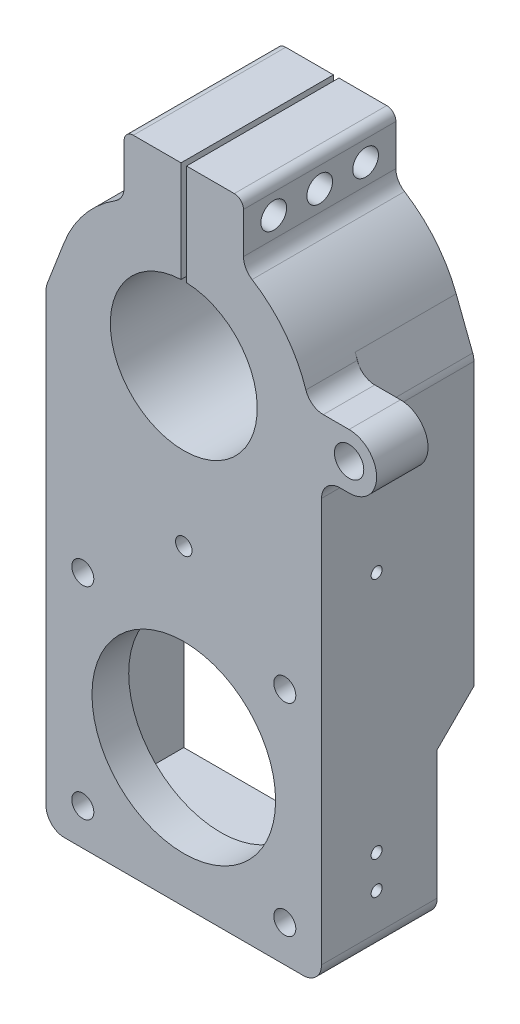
from build123d import *
from build123d.topology import SkipClean

# Parameters (mm, degrees)
SKETCH_1_R                      = 4.5
SKETCH_1_R_2                    = 50
SKETCH_1_R_3                    = 40
SKETCH_1_R_4                    = 8
SKETCH_1_R_5                    = 6
EXTRUDE_1_DEPTH                 = 28
EXTRUDE_START                   = 55
SKETCH_2_R                      = 40
SKETCH_2_R_2                    = 6
SKETCH_2_R_3                    = 50
SKETCH_2_R_4                    = 4.5
EXTRUDE_2_DEPTH                 = 55
CUT_EXTRUDE_1_DEPTH             = 63
SKETCH_4_W                      = 3
SKETCH_4_H                      = 117.520101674
CUT_EXTRUDE_2_DEPTH             = 63
SKETCH_5_R                      = 7
CUT_EXTRUDE_3_DEPTH             = 10
CUT_EXTRUDE_4_REACH             = 298.911
SKETCH_6_R                      = 4.5
CUT_EXTRUDE_4_DIRECTION_2_DEPTH = 297.911182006
CUT_EXTRUDE_5_DEPTH             = 150
SKETCH_8_R                      = 3
CUT_EXTRUDE_6_DEPTH             = 12
SKETCH_9_R                      = 2.5
CUT_EXTRUDE_7_DEPTH             = 15


with BuildPart() as part:
    # Sketch 1 → Extrude 1 (new body)
    with BuildSketch(Plane.XY):
        with BuildLine():
            Line((0, -75), (-65, -75))
            ThreePointArc((-65, -75), (-72.071067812, -72.071067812), (-75, -65))
            Line((-75, -65), (-75, 178.143043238))
            ThreePointArc((-75, 178.143043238), (-74.831920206, 179.968788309), (-74.333330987, 181.733159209))
            Line((-74.333330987, 181.733159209), (-65.333300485, 205.130805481))
            ThreePointArc((-65.333300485, 205.130805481), (-54.033305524, 224.501678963), (-37.187498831, 239.305037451))
            ThreePointArc((-37.187498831, 239.305037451), (-33.749999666, 242.935959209), (-32.5, 247.777187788))
            Line((-32.5, 247.777187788), (-32.5, 270))
            ThreePointArc((-32.5, 270), (-31.035533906, 273.535533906), (-27.5, 275))
            Line((-27.5, 275), (0, 275))
            Line((0, 275), (27.5, 275))
            ThreePointArc((27.5, 275), (31.035533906, 273.535533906), (32.5, 270))
            Line((32.5, 270), (32.5, 247.777187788))
            ThreePointArc((32.5, 247.777187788), (33.749999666, 242.935959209), (37.187498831, 239.305037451))
            ThreePointArc((37.187498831, 239.305037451), (55.11557762, 223.154033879), (66.494224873, 201.874999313))
            ThreePointArc((66.494224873, 201.874999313), (70.130382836, 196.899073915), (75.993402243, 195))
            Line((75.993402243, 195), (90, 195))
            ThreePointArc((90, 195), (105, 180), (90, 165))
            Line((90, 165), (85, 165))
            ThreePointArc((85, 165), (77.928932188, 162.071067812), (75, 155))
            Line((75, 155), (75, -65))
            ThreePointArc((75, -65), (72.071067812, -72.071067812), (65, -75))
            Line((65, -75), (0, -75))
        make_face()
        with Locations((0, 95)):
            Circle(SKETCH_1_R, mode=Mode.SUBTRACT)
        Circle(SKETCH_1_R_2, mode=Mode.SUBTRACT)
        with Locations((0, 180)):
            Circle(SKETCH_1_R_3, mode=Mode.SUBTRACT)
        with Locations((90, 180)):
            Circle(SKETCH_1_R_4, mode=Mode.SUBTRACT)
        with Locations((55, -55)):
            Circle(SKETCH_1_R_5, mode=Mode.SUBTRACT)
        with Locations(Location((-55, -55, 0), (0, 0, 180))):
            Circle(SKETCH_1_R_5, mode=Mode.SUBTRACT)
        with Locations(Location((55, 55, 0), (0, 0, 180))):
            Circle(SKETCH_1_R_5, mode=Mode.SUBTRACT)
        with Locations((-55, 55)):
            Circle(SKETCH_1_R_5, mode=Mode.SUBTRACT)
    extrude(amount=EXTRUDE_1_DEPTH)

    # Sketch 2 → Extrude 2 (add)
    with SkipClean():  # the faces are left unmerged after this step: merging them gives an invalid solid
        with BuildSketch(Plane(origin=(0, 0, 0), x_dir=(-1, 0, 0), z_dir=(0, 0, -1)).offset(EXTRUDE_START)):
            with BuildLine():
                Line((-32.5, 247.777187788), (-32.5, 270))
                ThreePointArc((-32.5, 270), (-31.035533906, 273.535533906), (-27.5, 275))
                Line((-27.5, 275), (27.5, 275))
                ThreePointArc((27.5, 275), (31.035533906, 273.535533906), (32.5, 270))
                Line((32.5, 270), (32.5, 247.777187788))
                ThreePointArc((32.5, 247.777187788), (33.749999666, 242.935959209), (37.187498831, 239.305037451))
                ThreePointArc((37.187498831, 239.305037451), (54.033305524, 224.501678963), (65.333300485, 205.130805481))
                Line((65.333300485, 205.130805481), (74.333330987, 181.733159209))
                ThreePointArc((74.333330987, 181.733159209), (74.831920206, 179.968788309), (75, 178.143043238))
                Line((75, 178.143043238), (75, -65))
                ThreePointArc((75, -65), (72.071067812, -72.071067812), (65, -75))
                Line((65, -75), (-65, -75))
                ThreePointArc((-65, -75), (-72.071067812, -72.071067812), (-75, -65))
                Line((-75, -65), (-75, 178.143043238))
                ThreePointArc((-75, 178.143043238), (-74.831920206, 179.968788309), (-74.333330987, 181.733159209))
                Line((-74.333330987, 181.733159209), (-65.333300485, 205.130805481))
                ThreePointArc((-65.333300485, 205.130805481), (-54.033305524, 224.501678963), (-37.187498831, 239.305037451))
                ThreePointArc((-37.187498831, 239.305037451), (-33.749999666, 242.935959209), (-32.5, 247.777187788))
            make_face()
            with Locations((0, 180)):
                Circle(SKETCH_2_R, mode=Mode.SUBTRACT)
            with Locations((-55, -55)):
                Circle(SKETCH_2_R_2, mode=Mode.SUBTRACT)
            with Locations((55, -55)):
                Circle(SKETCH_2_R_2, mode=Mode.SUBTRACT)
            Circle(SKETCH_2_R_3, mode=Mode.SUBTRACT)
            with Locations((55, 55)):
                Circle(SKETCH_2_R_2, mode=Mode.SUBTRACT)
            with Locations((0, 95)):
                Circle(SKETCH_2_R_4, mode=Mode.SUBTRACT)
            with Locations((-55, 55)):
                Circle(SKETCH_2_R_2, mode=Mode.SUBTRACT)
        extrude(amount=-EXTRUDE_2_DEPTH)

    # Sketch 3 → Cut-Extrude 1 (cut)
    with SkipClean():  # the faces are left unmerged after this step: merging them gives an invalid solid
        with BuildSketch(Plane(origin=(0, 0, -55), x_dir=(-1, 0, 0), z_dir=(0, 0, -1))):
            with BuildLine():
                Line((63, 109.850160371), (63, -63))
                Line((63, -63), (-63, -63))
                Line((-63, -63), (-63, 109.850160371))
                ThreePointArc((-63, 109.850160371), (-54.997898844, 123.117767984), (-39.529411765, 122.229543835))
                ThreePointArc((-39.529411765, 122.229543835), (0, 110), (39.529411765, 122.229543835))
                ThreePointArc((39.529411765, 122.229543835), (54.997898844, 123.117767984), (63, 109.850160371))
            make_face()
        extrude(amount=-CUT_EXTRUDE_1_DEPTH, mode=Mode.SUBTRACT)

    # Sketch 4 → Cut-Extrude 2 (cut)
    with BuildSketch(Plane(origin=(0, 275, 0), x_dir=(1, 0, 0), z_dir=(0, 1, 0))):
        Rectangle(SKETCH_4_W, SKETCH_4_H)
    extrude(amount=-CUT_EXTRUDE_2_DEPTH, mode=Mode.SUBTRACT)

    # Sketch 5 → Cut-Extrude 3 (cut)
    with BuildSketch(Plane(origin=(32.5, 0, 0), x_dir=(0, 0, -1), z_dir=(1, 0, 0))):
        with Locations(Location((13.5, 259, 0), (0, 0, 90))):
            Circle(SKETCH_5_R)
        with Locations(Location((-11.5, 259, 0), (0, 0, 90))):
            Circle(SKETCH_5_R)
        with Locations(Location((38.5, 259, 0), (0, 0, 90))):
            Circle(SKETCH_5_R)
    extrude(amount=-CUT_EXTRUDE_3_DEPTH, mode=Mode.SUBTRACT)

    # Cut-Extrude 4: up to this face of the body (flat: up to its plane)
    cut_extrude_4_end = Plane(part.part.faces().sort_by_distance((-32.5, 258.888593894, -13.5))[0])
    # Sketch 6 → Cut-Extrude 4 (cut, up to the picked face)
    with BuildSketch(Plane(origin=(22.5, 0, 0), x_dir=(0, 0, -1), z_dir=(1, 0, 0)), mode=Mode.PRIVATE) as cut_extrude_4_sk1:
        with Locations(Location((-11.5, 259, 0), (0, 0, 90))):
            Circle(SKETCH_6_R)
    cut_extrude_4_tool1 = split(extrude(cut_extrude_4_sk1.sketch, amount=-CUT_EXTRUDE_4_REACH, mode=Mode.PRIVATE), bisect_by=cut_extrude_4_end, keep=Keep.BOTH, mode=Mode.PRIVATE)
    # Sketch 6 → Cut-Extrude 4 (cut, up to the picked face)
    with BuildSketch(Plane(origin=(22.5, 0, 0), x_dir=(0, 0, -1), z_dir=(1, 0, 0)), mode=Mode.PRIVATE) as cut_extrude_4_sk2:
        with Locations(Location((13.5, 259, 0), (0, 0, 90))):
            Circle(SKETCH_6_R)
    cut_extrude_4_tool2 = split(extrude(cut_extrude_4_sk2.sketch, amount=-CUT_EXTRUDE_4_REACH, mode=Mode.PRIVATE), bisect_by=cut_extrude_4_end, keep=Keep.BOTH, mode=Mode.PRIVATE)
    # Sketch 6 → Cut-Extrude 4 (cut, up to the picked face)
    with BuildSketch(Plane(origin=(22.5, 0, 0), x_dir=(0, 0, -1), z_dir=(1, 0, 0)), mode=Mode.PRIVATE) as cut_extrude_4_sk3:
        with Locations(Location((38.5, 259, 0), (0, 0, 90))):
            Circle(SKETCH_6_R)
    cut_extrude_4_tool3 = split(extrude(cut_extrude_4_sk3.sketch, amount=-CUT_EXTRUDE_4_REACH, mode=Mode.PRIVATE), bisect_by=cut_extrude_4_end, keep=Keep.BOTH, mode=Mode.PRIVATE)
    add(cut_extrude_4_tool1.solids().sort_by(Axis((22.5, 259, 11.5), (-1, 0, 0)))[0], mode=Mode.SUBTRACT)
    add(cut_extrude_4_tool2.solids().sort_by(Axis((22.5, 259, -13.5), (-1, 0, 0)))[0], mode=Mode.SUBTRACT)
    add(cut_extrude_4_tool3.solids().sort_by(Axis((22.5, 259, -38.5), (-1, 0, 0)))[0], mode=Mode.SUBTRACT)

    # Sketch 6 → Cut-Extrude 4 direction 2 (cut)
    with BuildSketch(Plane(origin=(22.5, 0, 0), x_dir=(0, 0, -1), z_dir=(1, 0, 0))):
        with Locations(Location((-11.5, 259, 0), (0, 0, 90))):
            Circle(SKETCH_6_R)
        with Locations(Location((13.5, 259, 0), (0, 0, 90))):
            Circle(SKETCH_6_R)
        with Locations(Location((38.5, 259, 0), (0, 0, 90))):
            Circle(SKETCH_6_R)
    extrude(amount=CUT_EXTRUDE_4_DIRECTION_2_DEPTH, mode=Mode.SUBTRACT)

    # Sketch 7 → Cut-Extrude 5 (cut)
    with BuildSketch(Plane(origin=(75, 0, 0), x_dir=(0, 0, -1), z_dir=(1, 0, 0))):
        Polygon((35, -75), (55, -75), (55, 25), (35, 5), align=None)
    extrude(amount=-CUT_EXTRUDE_5_DEPTH, mode=Mode.SUBTRACT)

    # Sketch 8 → Cut-Extrude 6 (cut)
    with BuildSketch(Plane(origin=(75, 0, 0), x_dir=(0, 0, -1), z_dir=(1, 0, 0))):
        with Locations(Location((2, -45, 0), (0, 0, 90))):
            Circle(SKETCH_8_R)
        with Locations(Location((2, -27, 0), (0, 0, 90))):
            Circle(SKETCH_8_R)
        with Locations(Location((2, 105, 0), (0, 0, 90))):
            Circle(SKETCH_8_R)
    extrude(amount=-CUT_EXTRUDE_6_DEPTH, mode=Mode.SUBTRACT)

    # Sketch 9 → Cut-Extrude 7 (cut)
    with BuildSketch(Plane(origin=(-125.647233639, 48.330884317, 0), x_dir=(0, 0, 1), z_dir=(-0.9333330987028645, 0.35901159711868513, 0))):
        with Locations(Location((-2, 170.465891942, 0), (0, 0, 270))):
            Circle(SKETCH_9_R)
        with Locations(Location((-2, 148.465891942, 0), (0, 0, 270))):
            Circle(SKETCH_9_R)
    extrude(amount=-CUT_EXTRUDE_7_DEPTH, mode=Mode.SUBTRACT)


solid = part.part
